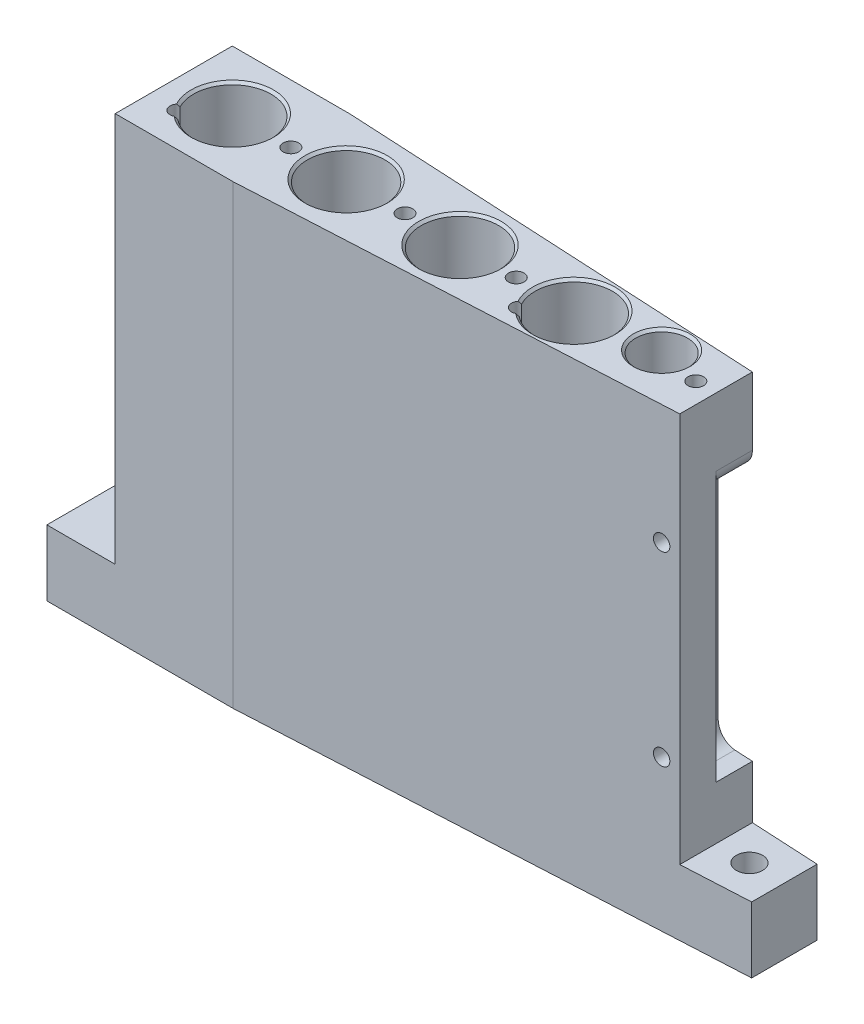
from build123d import *

# Parameters (mm, degrees)
BOSS_EXTRUDE1_DEPTH                = 46.75
F_5_16_0_3125_DIAMETER_HOLE1_D     = 7.9375
F_5_16_0_3125_DIAMETER_HOLE1_DEPTH = 41
F_1_16_0_0625_DIAMETER_HOLE3_D     = 1.5875
LPATTERN1_COUNT                    = 3
LPATTERN1_PITCH                    = 11.666666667
LPATTERN2_COUNT                    = 2
LPATTERN2_PITCH                    = 35
F_1_16_0_0625_DIAMETER_HOLE4_D     = 1.5875
F_4_0_209_DIAMETER_HOLE1_D         = 5.3086
SKETCH14_W                         = 14
SKETCH14_H                         = 7
SKETCH14_W_2                       = 7.440642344
CUT_EXTRUDE1_DEPTH                 = 40
M2_5_CLEARANCE_HOLE1_D             = 2.7
F_1_16_0_0625_DIAMETER_HOLE1_D     = 1.5875
F_1_16_0_0625_DIAMETER_HOLE1_DEPTH = 5
F_1_16_0_0625_DIAMETER_HOLE2_D     = 1.5875
F_1_16_0_0625_DIAMETER_HOLE2_DEPTH = 6
F_1_16_0_0625_DIAMETER_HOLE2_TIP   = 0.476933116
M2X0_4_TAPPED_HOLE2_D              = 1.6
M2X0_4_TAPPED_HOLE2_DEPTH          = 5.2
M2X0_4_TAPPED_HOLE2_TIP            = 0.480688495
SKETCH42_OUTSIDE_W                 = 88.578
SKETCH42_OUTSIDE_H                 = 32.998
CUT_EXTRUDE2_DEPTH                 = 85.118600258
CHAMFER2_SIZE                      = 0.93325
CHAMFER2_SIZE2                     = 0.538812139
CHAMFER3_SIZE                      = 0.25
F_37_0_104_DIAMETER_HOLE1_D        = 2.6416
F_37_0_104_DIAMETER_HOLE1_DEPTH    = 4
F_37_0_104_DIAMETER_HOLE1_TIP      = 0.793616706
SKETCH50_W                         = 3.7
SKETCH50_H                         = 25.8
CUT_EXTRUDE4_DEPTH                 = 85.041292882
M2X0_4_TAPPED_HOLE3_D              = 1.6
FILLET1_R                          = 1.8


with BuildPart() as part:
    # Sketch1 → Boss-Extrude1 (new body)
    with BuildSketch(Plane(origin=(0, 0, 0), x_dir=(1, 0, 0), z_dir=(0, 1, 0))):
        Polygon((0, 7), (0, -7), (69.58, -3.353466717), (69.58, 3.353466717), align=None)
    extrude(amount=BOSS_EXTRUDE1_DEPTH)

    # 5_16 _0.3125_ Diameter Hole1
    with Locations(Plane(origin=(-12.105298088, 46.75, 2.056471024), x_dir=(-1, 0, 0), z_dir=(0, 1, 0))):
        with Locations((-25.105298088, -2.056471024)):
            f_5_16_0_3125_diameter_hole1 = Hole(F_5_16_0_3125_DIAMETER_HOLE1_D / 2, depth=F_5_16_0_3125_DIAMETER_HOLE1_DEPTH)

    # 1_16 _0.0625_ Diameter Hole3 (through all)
    with Locations(Plane(origin=(0, 0, 0), x_dir=(-1, 0, 0), z_dir=(0, -1, 0))):
        with Locations((-13, 0)):
            f_1_16_0_0625_diameter_hole3 = Hole(F_1_16_0_0625_DIAMETER_HOLE3_D / 2)

    # LPattern1: 5_16 _0.3125_ Diameter Hole1, 1_16 _0.0625_ Diameter Hole3 ×3
    with Locations(*[(i * LPATTERN1_PITCH, 0, 0) for i in range(1, LPATTERN1_COUNT)]):
        add(f_5_16_0_3125_diameter_hole1, mode=Mode.SUBTRACT)
        add(f_1_16_0_0625_diameter_hole3, mode=Mode.SUBTRACT)

    # LPattern2: 5_16 _0.3125_ Diameter Hole1 ×2
    with Locations(*[(i * LPATTERN2_PITCH, 0, 0) for i in range(1, LPATTERN2_COUNT)]):
        add(f_5_16_0_3125_diameter_hole1, mode=Mode.SUBTRACT)

    # 1_16 _0.0625_ Diameter Hole4 (through all)
    with Locations(Plane(origin=(0, 0, 0), x_dir=(-1, 0, 0), z_dir=(0, -1, 0))):
        with Locations((-48.7, 0)):
            Hole(F_1_16_0_0625_DIAMETER_HOLE4_D / 2)

    # 4 _0.209_ Diameter Hole1 (through all)
    with Locations(Plane(origin=(0, 46.75, 0), x_dir=(-1, 0, 0), z_dir=(0, 1, 0))):
        with Locations((-56, -1)):
            Hole(F_4_0_209_DIAMETER_HOLE1_D / 2)

    # Sketch14 → Cut-Extrude1 (cut)
    with BuildSketch(Plane(origin=(52.25, 46.75, 0), x_dir=(0, 0, 1), z_dir=(0, -1, 0))):
        with Locations((0, 48.75)):
            Rectangle(SKETCH14_W, SKETCH14_H)
        with Locations((0, -13.83)):
            Rectangle(SKETCH14_W_2, SKETCH14_H)
    extrude(amount=CUT_EXTRUDE1_DEPTH, mode=Mode.SUBTRACT)

    # M2.5 Clearance Hole1 (through all)
    with Locations(Plane(origin=(-31.378940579, 6.75, -5.818848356), x_dir=(-1, 0, 0), z_dir=(0, 1, 0))):
        with Locations((-34.878940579, 5.818848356), (-97.378940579, 5.818848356)):
            Hole(M2_5_CLEARANCE_HOLE1_D / 2)

    # 1_16 _0.0625_ Diameter Hole1
    with Locations(Plane.XZ):
        with Locations((8, 0), (62, 0)):
            Hole(F_1_16_0_0625_DIAMETER_HOLE1_D / 2, depth=F_1_16_0_0625_DIAMETER_HOLE1_DEPTH)

    # 1_16 _0.0625_ Diameter Hole2
    with Locations(Plane(origin=(0, 46.75, 0), x_dir=(1, 0, 0), z_dir=(0, 1, 0))):
        with Locations((44.917634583, -2.5), (9.917634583, -2.5)):
            Hole(F_1_16_0_0625_DIAMETER_HOLE2_D / 2, depth=F_1_16_0_0625_DIAMETER_HOLE2_DEPTH)
            with Locations((0, 0, -(F_1_16_0_0625_DIAMETER_HOLE2_DEPTH + F_1_16_0_0625_DIAMETER_HOLE2_TIP / 2))):  # 118° drill point
                Cone(0, F_1_16_0_0625_DIAMETER_HOLE2_D / 2, F_1_16_0_0625_DIAMETER_HOLE2_TIP, mode=Mode.SUBTRACT)

    # M2x0.4 Tapped Hole2
    with Locations(Plane(origin=(0, 46.75, 0), x_dir=(1, 0, 0), z_dir=(0, 1, 0))):
        with Locations((19, 0), (30.7, 0), (42.1, 0), (60.5, 0)):
            Hole(M2X0_4_TAPPED_HOLE2_D / 2, depth=M2X0_4_TAPPED_HOLE2_DEPTH)
            with Locations((0, 0, -(M2X0_4_TAPPED_HOLE2_DEPTH + M2X0_4_TAPPED_HOLE2_TIP / 2))):  # 118° drill point
                Cone(0, M2X0_4_TAPPED_HOLE2_D / 2, M2X0_4_TAPPED_HOLE2_TIP, mode=Mode.SUBTRACT)

    # Sketch38 → Cut-Revolve2 (revolve, cut)
    with BuildSketch(Plane.XY):
        with BuildLine():
            Line((11.1, 10.58125), (11.1, 5.81875))
            ThreePointArc((11.1, 5.81875), (8.71875, 8.2), (11.1, 10.58125))
        make_face()
    revolve(axis=Axis((11.1, 12.477737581, 0), (0, -1, 0)), mode=Mode.SUBTRACT)

    # Sketch42 outside → Cut-Extrude2 (cut, through all)
    with BuildSketch(Plane(origin=(0, 0, 0), x_dir=(1, 0, 0), z_dir=(0, 1, 0))):
        with Locations((34.79, 0)):
            Rectangle(SKETCH42_OUTSIDE_W, SKETCH42_OUTSIDE_H)
        Polygon((0, 6), (19.081136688, 6), (69.58, 3.353466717), (69.58, -3.353466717), (19.081136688, -6), (0, -6), align=None, mode=Mode.SUBTRACT)
    extrude(amount=CUT_EXTRUDE2_DEPTH, mode=Mode.SUBTRACT)

    # Chamfer2
    chamfer2_edges = [part.edges().sort_by_distance(p)[0] for p in [
        (47.90625, 0, 0),
    ]]
    chamfer2_side = [part.faces().sort_by_distance(p)[0] for p in [
        (30.464105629, 0, 0.033747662),
    ]]
    chamfer(chamfer2_edges, length=CHAMFER2_SIZE, length2=CHAMFER2_SIZE2, reference=chamfer2_side[0])

    # Chamfer3
    chamfer3_edges = [part.edges().sort_by_distance(p)[0] for p in [
        (12.054464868, 46.75, -3.854470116),
        (47.054464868, 46.75, -3.854470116),
        (20.697916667, 46.75, 0),
        (32.364583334, 46.75, 0),
        (53.3457, 46.75, -1),
    ]]
    chamfer(chamfer3_edges, length=CHAMFER3_SIZE)

    # 37 _0.104_ Diameter Hole1
    with Locations(Plane(origin=(0, 0, 0), x_dir=(-1, 0, 0), z_dir=(0, -1, 0))):
        with Locations((-13, 0)):
            Hole(F_37_0_104_DIAMETER_HOLE1_D / 2, depth=F_37_0_104_DIAMETER_HOLE1_DEPTH)
            with Locations((0, 0, -(F_37_0_104_DIAMETER_HOLE1_DEPTH + F_37_0_104_DIAMETER_HOLE1_TIP / 2))):  # 118° drill point
                Cone(0, F_37_0_104_DIAMETER_HOLE1_D / 2, F_37_0_104_DIAMETER_HOLE1_TIP, mode=Mode.SUBTRACT)

    # Sketch50 → Cut-Extrude4 (cut, through all)
    with BuildSketch(Plane.XY):
        with Locations((60.73, 25.1)):
            Rectangle(SKETCH50_W, SKETCH50_H)
    extrude(amount=-CUT_EXTRUDE4_DEPTH, mode=Mode.SUBTRACT)

    # M2x0.4 Tapped Hole3 (through all)
    with Locations(Plane(origin=(0.25675836, -3.553101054, 0), x_dir=(-1, 0, 0), z_dir=(0, 0, -1))):
        with Locations((-60.55824164, 38.058101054), (-60.55824164, 19.008101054)):
            Hole(M2X0_4_TAPPED_HOLE3_D / 2)

    # Fillet1
    fillet1_edges = [part.edges().sort_by_distance(p)[0] for p in [
        (62.58, 38, -1.860160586),
        (58.88, 12.2, -1.957114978),
        (58.88, 38, -1.957114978),
    ]]
    fillet(fillet1_edges, radius=FILLET1_R)


solid = part.part
